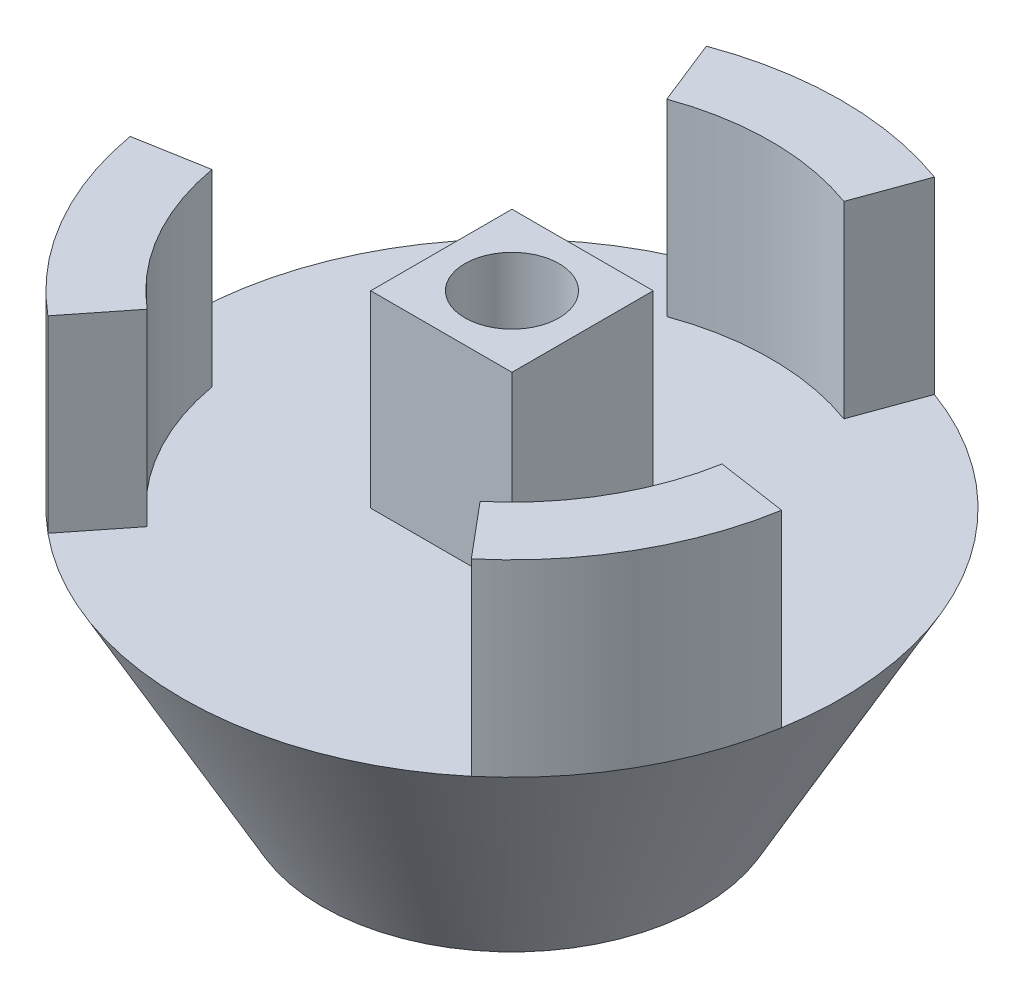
from build123d import *

# Parameters (mm, degrees)
SKETCH2_W                   = 7.62
SKETCH2_H                   = 7.62
BOSS_EXTRUDE1_DEPTH         = 10.16
F_34_0_111_DIAMETER_HOLE1_D = 5.08


with BuildPart() as part:
    # Sketch1 → Revolve1 (revolve)
    with BuildSketch(Plane.XY):
        with BuildLine():
            Line((3.8862, 7.14375), (3.8862, 0.762))
            ThreePointArc((3.8862, 0.762), (4.109384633, 0.223184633), (4.6482, 0))
            Line((4.6482, 0), (10.2362, 0))
            Line((10.2362, 0), (17.78, 13.49375))
            Line((17.78, 13.49375), (0, 13.49375))
            Line((0, 13.49375), (0, 7.14375))
            Line((0, 7.14375), (3.8862, 7.14375))
        make_face()
    revolve(axis=Axis((0, -350.330206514, 0), (0, 1, 0)))

    # Sketch2 → Boss-Extrude1 (add)
    with BuildSketch(Plane(origin=(0, 13.49375, 0), x_dir=(1, 0, 0), z_dir=(0, 1, 0))):
        Rectangle(SKETCH2_W, SKETCH2_H)
        with BuildLine():
            Line((-6.182963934, 16.670313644), (-4.778021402, 13.127505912))
            ThreePointArc((-4.778021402, 13.127505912), (0, 13.97), (4.778021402, 13.127505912))
            Line((4.778021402, 13.127505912), (6.081118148, 16.707734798))
            ThreePointArc((6.081118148, 16.707734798), (-0.054251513, 17.779917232), (-6.182963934, 16.670313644))
        make_face()
        with BuildLine():
            Line((17.528397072, -2.980552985), (13.75776431, -2.425865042))
            ThreePointArc((13.75776431, -2.425865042), (12.098374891, -6.985), (8.979742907, -10.70164087))
            Line((8.979742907, -10.70164087), (11.4287637, -13.620270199))
            ThreePointArc((11.4287637, -13.620270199), (15.424985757, -8.842975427), (17.528397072, -2.980552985))
        make_face()
        with BuildLine():
            Line((-11.345433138, -13.689760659), (-8.979742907, -10.70164087))
            ThreePointArc((-8.979742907, -10.70164087), (-12.098374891, -6.985), (-13.75776431, -2.425865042))
            Line((-13.75776431, -2.425865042), (-17.509881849, -3.087464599))
            ThreePointArc((-17.509881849, -3.087464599), (-15.370734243, -8.936941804), (-11.345433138, -13.689760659))
        make_face()
    extrude(amount=BOSS_EXTRUDE1_DEPTH)

    # 34 _0.111_ Diameter Hole1 (through all)
    with Locations(Plane(origin=(0, 23.65375, 0), x_dir=(1, 0, 0), z_dir=(0, 1, 0))):
        with Locations((0, 0)):
            Hole(F_34_0_111_DIAMETER_HOLE1_D / 2)


solid = part.part
